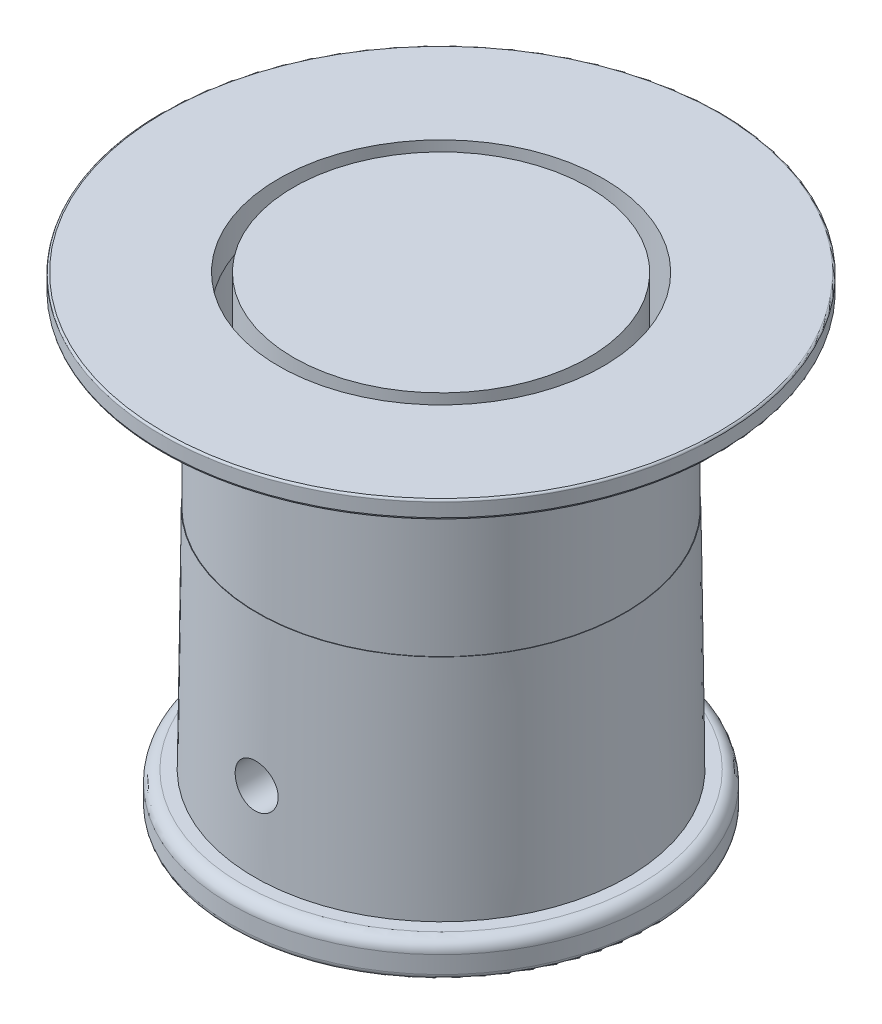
from build123d import *

# Parameters (mm, degrees)
SKETCH1_R                      = 28.575
BOTTOM_RIM_DEPTH               = 4.699
BOTTOM_RIM_TOP_FILLET_R        = 1.5748
SKETCH5_R                      = 9.3472
CENTER_DIA_LG_DEPTH            = 30.861
SKETCH7_R                      = 22.6822
SKETCH7_R_2                    = 11.6205
INSIDE_DIA_CUT_DEPTH           = 30.861
BOTTOM_RIM_BOT_FILLET_R        = 0.7874
RIBS_DEPTH                     = 30.861
CENTRAL_START                  = 14.7828
CENTRAL_CROSS_RIB_W_HOLE_DEPTH = 14.7828
SKETCH10_R                     = 2.4765
CENTER_DIA_SMALL_DEPTH         = 9.906
F_23_DIA_DEPTH                 = 11.684
F_23_DIA_DEPTH_BACK            = 10.4394
SKETCH14_R                     = 2.921
F_8_32_TAPPED_HOLE1_REACH      = 64.901
F_8_32_TAPPED_HOLE1_BORE_R     = 1.7272
SKETCH19_R                     = 2.921
CUT_EXTRUDE1_DEPTH             = 3.81
CUT_EXTRUDE2_DEPTH             = 22.86
SKETCH22_R                     = 22.352
CUT_EXTRUDE3_DEPTH             = 10.16
SKETCH23_R                     = 20.036315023
EXTRUDE1_DEPTH                 = 19.05


with BuildPart() as part:
    # Sketch1 → BOTTOM RIM (new body)
    with BuildSketch(Plane(origin=(0, 0, 0), x_dir=(1, 0, 0), z_dir=(0, 1, 0))):
        with Locations(Location((0, 0, 0), (0, 0, 270))):
            Circle(SKETCH1_R)
    extrude(amount=BOTTOM_RIM_DEPTH)

    # BOTTOM RIM TOP FILLET
    bottom_rim_top_fillet_edges = [part.edges().sort_by_distance(p)[0] for p in [
        (0, 4.699, -28.575),
    ]]
    fillet(bottom_rim_top_fillet_edges, radius=BOTTOM_RIM_TOP_FILLET_R)

    # Sketch4 → BODY (revolve)
    with BuildSketch(Plane.XY, mode=Mode.PRIVATE) as body_sk:
        Polygon((0, 4.699), (0, 35.56), (-24.9555, 35.56), (-25.3365, 4.699), align=None)
    revolve(body_sk.sketch.rotate(Axis((0, -1.955160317, 0), (0, 1, 0)), 270), axis=Axis((0, -1.955160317, 0), (0, 1, 0)))

    # Sketch5 → CENTER DIA LG (cut)
    with BuildSketch(Plane(origin=(0, 35.56, 0), x_dir=(-1, 0, 0), z_dir=(0, 1, 0))):
        with Locations(Location((0, 0, 0), (0, 0, 90))):
            Circle(SKETCH5_R)
    extrude(amount=-CENTER_DIA_LG_DEPTH, mode=Mode.SUBTRACT)

    # Sketch7 → INSIDE DIA CUT (cut)
    with BuildSketch(Plane(origin=(0, 35.56, 0), x_dir=(-1, 0, 0), z_dir=(0, 1, 0))):
        with Locations(Location((0, 0, 0), (0, 0, 90))):
            Circle(SKETCH7_R)
        with Locations(Location((0, 0, 0), (0, 0, 90))):
            Circle(SKETCH7_R_2, mode=Mode.SUBTRACT)
    extrude(amount=-INSIDE_DIA_CUT_DEPTH, mode=Mode.SUBTRACT)

    # BOTTOM RIM BOT FILLET
    bottom_rim_bot_fillet_edges = [part.edges().sort_by_distance(p)[0] for p in [
        (0, 0, -28.575),
    ]]
    fillet(bottom_rim_bot_fillet_edges, radius=BOTTOM_RIM_BOT_FILLET_R)

    # Sketch8 → RIBS (add)
    with BuildSketch(Plane(origin=(0, 35.56, 0), x_dir=(-1, 0, 0), z_dir=(0, 1, 0))):
        with BuildLine():
            Line((1.524, -22.630943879), (1.524, -11.520132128))
            ThreePointArc((1.524, -11.520132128), (0, -11.6205), (-1.524, -11.520132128))
            Line((-1.524, -11.520132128), (-1.524, -22.630943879))
            ThreePointArc((-1.524, -22.630943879), (0, -22.6822), (1.524, -22.630943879))
        make_face()
        with BuildLine():
            Line((-22.630943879, 1.524), (-11.520132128, 1.524))
            ThreePointArc((-11.520132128, 1.524), (-11.6205, 0), (-11.520132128, -1.524))
            Line((-11.520132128, -1.524), (-22.630943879, -1.524))
            ThreePointArc((-22.630943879, -1.524), (-22.6822, 0), (-22.630943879, 1.524))
        make_face()
        with BuildLine():
            Line((1.524, 22.630943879), (1.524, 11.520132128))
            ThreePointArc((1.524, 11.520132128), (0, 11.6205), (-1.524, 11.520132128))
            Line((-1.524, 11.520132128), (-1.524, 22.630943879))
            ThreePointArc((-1.524, 22.630943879), (0, 22.6822), (1.524, 22.630943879))
        make_face()
        with BuildLine():
            Line((22.630943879, -1.524), (11.520132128, -1.524))
            ThreePointArc((11.520132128, -1.524), (11.6205, 0), (11.520132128, 1.524))
            Line((11.520132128, 1.524), (22.630943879, 1.524))
            ThreePointArc((22.630943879, 1.524), (22.6822, 0), (22.630943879, -1.524))
        make_face()
    extrude(amount=-RIBS_DEPTH)

    # Sketch9 → CENTRAL CROSS RIB W_HOLE (add)
    with BuildSketch(Plane(origin=(0, 4.699, 0), x_dir=(-1, 0, 0), z_dir=(0, 1, 0)).offset(CENTRAL_START)):
        with BuildLine():
            Line((1.524, -9.222124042), (1.524, -5.045673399))
            ThreePointArc((1.524, -5.045673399), (1.648748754, -4.620359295), (1.983466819, -4.329811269))
            ThreePointArc((1.983466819, -4.329811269), (4.510687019, -1.5281063), (4.206693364, 2.232742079))
            ThreePointArc((4.206693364, 2.232742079), (4.138118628, 2.41168252), (4.1148, 2.60188877))
            Line((4.1148, 2.60188877), (4.1148, 22.305842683))
            ThreePointArc((4.1148, 22.305842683), (0, 22.6822), (-4.1148, 22.305842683))
            Line((-4.1148, 22.305842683), (-4.1148, 2.60188877))
            ThreePointArc((-4.1148, 2.60188877), (-4.138118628, 2.41168252), (-4.206693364, 2.232742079))
            ThreePointArc((-4.206693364, 2.232742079), (-4.510687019, -1.5281063), (-1.983466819, -4.329811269))
            ThreePointArc((-1.983466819, -4.329811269), (-1.648748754, -4.620359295), (-1.524, -5.045673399))
            Line((-1.524, -5.045673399), (-1.524, -9.222124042))
            ThreePointArc((-1.524, -9.222124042), (0, -9.3472), (1.524, -9.222124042))
        make_face()
    extrude(amount=-CENTRAL_CROSS_RIB_W_HOLE_DEPTH)

    # Sketch10 → CENTER DIA SMALL (cut)
    with BuildSketch(Plane(origin=(0, 19.4818, 0), x_dir=(-1, 0, 0), z_dir=(0, 1, 0))):
        with Locations(Location((0, 0, 0), (0, 0, 90))):
            Circle(SKETCH10_R)
    extrude(amount=-CENTER_DIA_SMALL_DEPTH, mode=Mode.SUBTRACT)

    # Sketch14 → 23 DIA (cut, two sides: drawn at the far end of the back side and taken through both)
    with BuildSketch(Plane.XY.offset(25.1714).offset(-F_23_DIA_DEPTH_BACK)):
        with Locations((0, 15.367)):
            Circle(SKETCH14_R)
    extrude(amount=F_23_DIA_DEPTH + F_23_DIA_DEPTH_BACK, mode=Mode.SUBTRACT)

    # 8-32 Tapped Hole1 bore → 8-32 Tapped Hole1 (cut, up to next)
    with BuildSketch(Plane.XY.offset(14.732), mode=Mode.PRIVATE) as f_8_32_tapped_hole1_sk1:
        with Locations((0, 15.367)):
            Circle(F_8_32_TAPPED_HOLE1_BORE_R)
    f_8_32_tapped_hole1_tool1 = extrude(f_8_32_tapped_hole1_sk1.sketch, amount=-F_8_32_TAPPED_HOLE1_REACH, mode=Mode.PRIVATE) & part.part
    add(f_8_32_tapped_hole1_tool1.solids().sort_by_distance((0, 15.367, 14.732))[0], mode=Mode.SUBTRACT)

    # Sketch18 → Revolve1 (revolve)
    with BuildSketch(Plane.XY):
        Polygon((-22.630943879, 4.699), (-22.630943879, 35.56), (-22.300753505, 4.699), align=None)
    revolve(axis=Axis((0, 47.589495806, 0), (0, -1, 0)))

    # Sketch19 → Cut-Extrude1 (cut)
    with BuildSketch(Plane.XY.offset(25.1714)):
        with Locations((0, 15.367)):
            Circle(SKETCH19_R)
    extrude(amount=-CUT_EXTRUDE1_DEPTH, mode=Mode.SUBTRACT)


with BuildPart() as body_2:
    # Sketch20 → Revolve4 (revolve)
    with BuildSketch(Plane.XY, mode=Mode.PRIVATE) as revolve4_sk:
        with BuildLine():
            Line((-22.0472, 35.56), (-24.892, 35.56))
            Line((-24.892, 35.56), (-24.892, 60.398025))
            ThreePointArc((-24.892, 60.398025), (-25.008241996, 60.678658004), (-25.288875, 60.7949))
            Line((-25.288875, 60.7949), (-37.592, 60.7949))
            ThreePointArc((-37.592, 60.7949), (-37.771605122, 60.869294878), (-37.846, 61.0489))
            Line((-37.846, 61.0489), (-37.846, 62.8904))
            ThreePointArc((-37.846, 62.8904), (-37.771605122, 63.070005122), (-37.592, 63.1444))
            Line((-37.592, 63.1444), (-22.0472, 63.1444))
            Line((-22.0472, 63.1444), (-22.0472, 35.56))
        make_face()
    revolve(revolve4_sk.sketch.rotate(Axis((0, 15.367, 0), (0, 1, 0)), 270), axis=Axis((0, 15.367, 0), (0, 1, 0)))

    # Sketch21 → Cut-Extrude2 (cut)
    with BuildSketch(Plane(origin=(0, 58.42, 0), x_dir=(1, 0, 0), z_dir=(0, 1, 0))):
        with BuildLine():
            Line((15.589724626, 15.589724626), (15.805250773, 15.805250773))
            ThreePointArc((15.805250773, 15.805250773), (22.352, 0), (15.805250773, -15.805250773))
            Line((15.805250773, -15.805250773), (15.589724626, -15.589724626))
            ThreePointArc((15.589724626, -15.589724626), (22.0472, 0), (15.589724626, 15.589724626))
        make_face()
        with BuildLine():
            Line((-15.589724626, -15.589724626), (-15.805250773, -15.805250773))
            ThreePointArc((-15.805250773, -15.805250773), (-22.352, 0), (-15.805250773, 15.805250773))
            Line((-15.805250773, 15.805250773), (-15.589724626, 15.589724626))
            ThreePointArc((-15.589724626, 15.589724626), (-22.0472, 0), (-15.589724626, -15.589724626))
        make_face()
    extrude(amount=-CUT_EXTRUDE2_DEPTH, mode=Mode.SUBTRACT)

    # Sketch22 → Cut-Extrude3 (cut)
    with BuildSketch(Plane(origin=(0, 45.72, 0), x_dir=(-1, 0, 0), z_dir=(0, 1, 0))):
        with Locations(Location((0, 0, 0), (0, 0, 45))):
            Circle(SKETCH22_R)
    extrude(amount=-CUT_EXTRUDE3_DEPTH, mode=Mode.SUBTRACT)


with BuildPart() as body_3:
    # Sketch23 → Extrude1 (new body)
    with BuildSketch(Plane(origin=(0, 63.1444, 0), x_dir=(1, 0, 0), z_dir=(0, 1, 0))):
        with Locations(Location((0, 0, 0), (0, 0, 270))):
            Circle(SKETCH23_R)
    extrude(amount=-EXTRUDE1_DEPTH)


solid = Compound([part.part, body_2.part, body_3.part])
